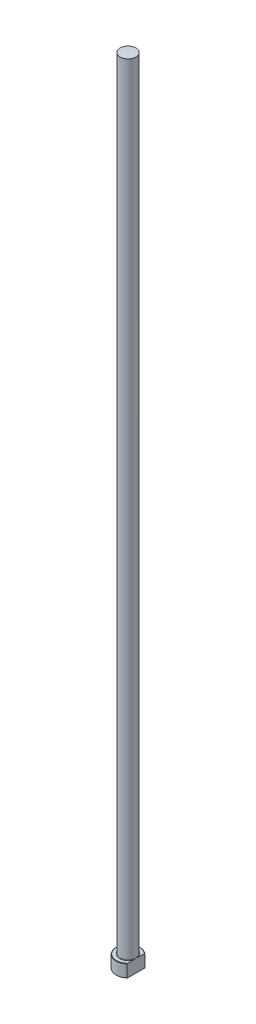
from build123d import *
from build123d.topology import SkipClean

# Parameters (mm, degrees)
CHAMFER1_SIZE    = 0.2
FILLET1_R        = 0.3
KEYED_HEAD_DEPTH = 501.112487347


with BuildPart() as part:
    # Sketch1 → Revolve1 (revolve)
    with BuildSketch(Plane.XY, mode=Mode.PRIVATE) as revolve1_sk:
        Polygon((0, 0), (-7.5, 0), (-7.5, 8), (-5, 8), (-5, 500), (0, 500), align=None)
    revolve(revolve1_sk.sketch.rotate(Axis((0, 259.958771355, 0), (0, -1, 0)), 270), axis=Axis((0, 259.958771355, 0), (0, -1, 0)))

    # Chamfer1
    chamfer1_edges = [part.edges().sort_by_distance(p)[0] for p in [
        (0, 8, -7.5),
        (0, 0, -7.5),
    ]]
    chamfer(chamfer1_edges, length=CHAMFER1_SIZE)

    # Fillet1
    fillet1_edges = [part.edges().sort_by_distance(p)[0] for p in [
        (0, 8, -5),
    ]]
    fillet(fillet1_edges, radius=FILLET1_R)

    # Sketch2 → KEYED HEAD (cut, through all)
    with SkipClean():  # the faces are left unmerged after this step: merging them gives an invalid solid
        with BuildSketch(Plane(origin=(0, 0, 0), x_dir=(1, 0, 0), z_dir=(0, 1, 0))):
            with BuildLine():
                Line((5, -5.590169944), (5, 5.590169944))
                ThreePointArc((5, 5.590169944), (7.5, 0), (5, -5.590169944))
            make_face()
        extrude(amount=KEYED_HEAD_DEPTH, mode=Mode.SUBTRACT)


solid = part.part
